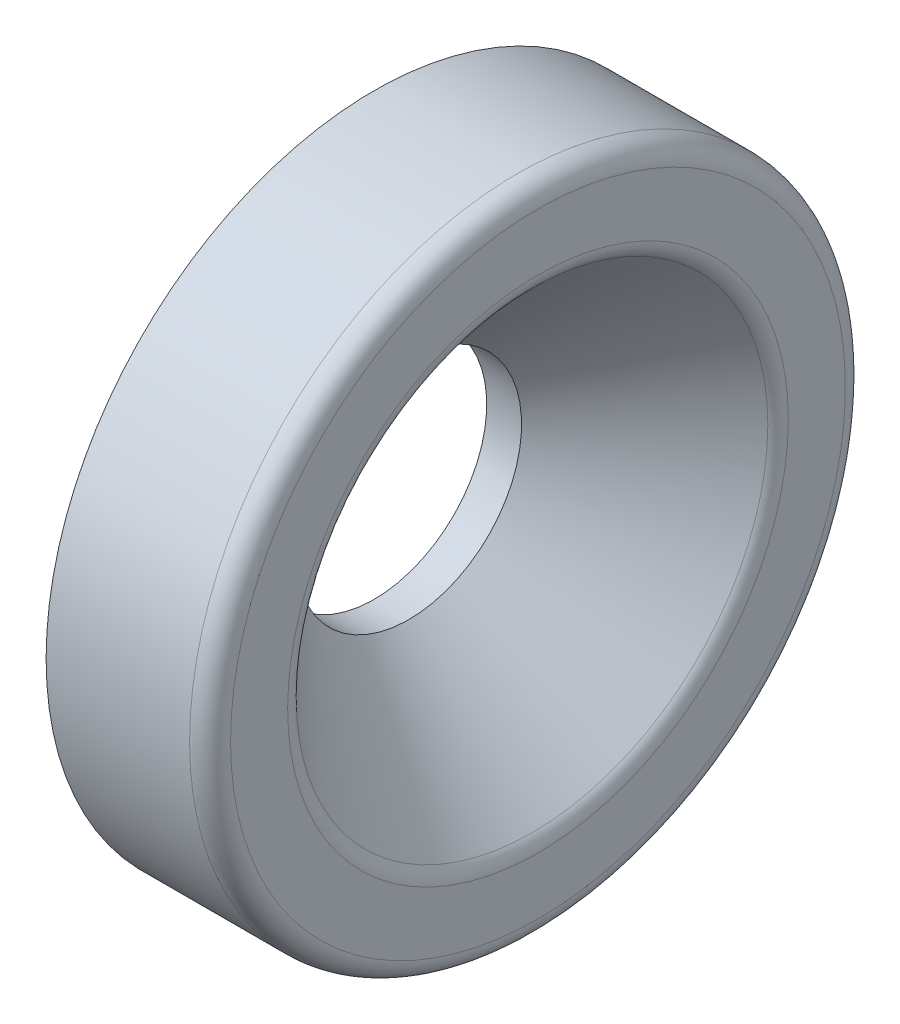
from build123d import *

# Parameters (mm, degrees)
CONG_1_R = 0.5


with BuildPart() as part:
    # Esquisse1 → Base-R_volution (revolve)
    with BuildSketch(Plane.XY, mode=Mode.PRIVATE) as base_r_volution_sk:
        Polygon((0, 2.75), (0, 8), (4, 8), (4, 5.9), (0.85, 2.75), align=None)
    revolve(base_r_volution_sk.sketch.rotate(Axis((0, 0, 0), (1, 0, 0)), 90), axis=Axis((0, 0, 0), (1, 0, 0)))

    # Cong_1
    cong_1_edges = [part.edges().sort_by_distance(p)[0] for p in [
        (4, 0, -5.9),
        (4, 0, -8),
    ]]
    fillet(cong_1_edges, radius=CONG_1_R)


solid = part.part
